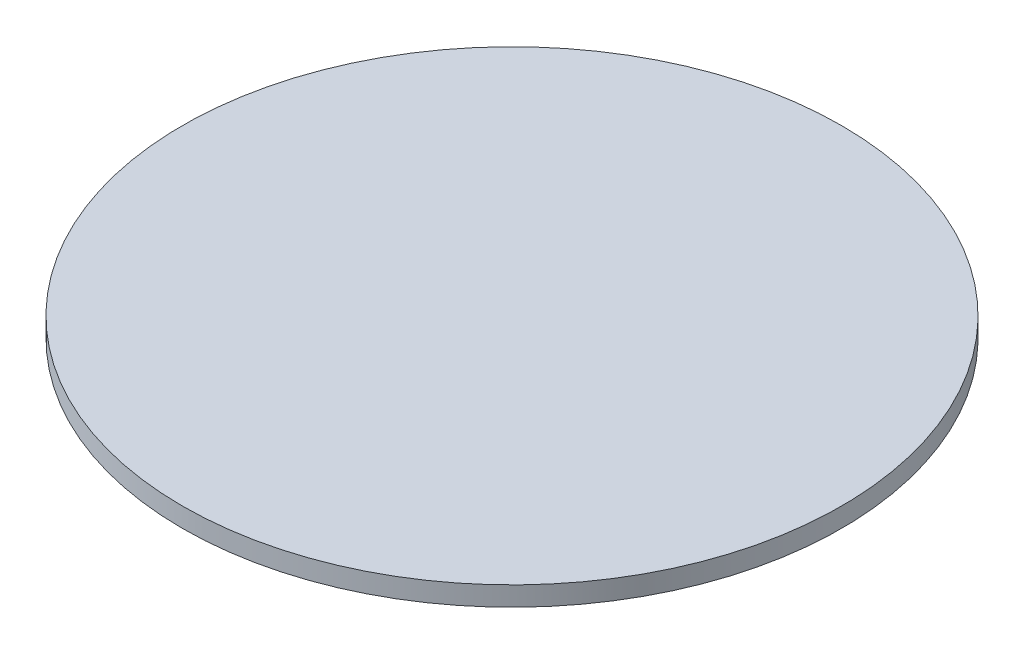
ISO-10303-21;
HEADER;
FILE_DESCRIPTION(('STEP AP214'),'2;1');
FILE_NAME('part.step','',(''),(''),'','','');
FILE_SCHEMA(('AUTOMOTIVE_DESIGN { 1 0 10303 214 1 1 1 1 }'));
ENDSEC;
DATA;
#1=APPLICATION_CONTEXT('core data for automotive mechanical design processes');
#2=APPLICATION_PROTOCOL_DEFINITION('international standard','automotive_design',2000,#1);
#3=PRODUCT_CONTEXT('',#1,'mechanical');
#4=PRODUCT('Part','Part','',(#3));
#5=PRODUCT_RELATED_PRODUCT_CATEGORY('part','',(#4));
#6=PRODUCT_DEFINITION_FORMATION('','',#4);
#7=PRODUCT_DEFINITION_CONTEXT('part definition',#1,'design');
#8=PRODUCT_DEFINITION('design','',#6,#7);
#9=PRODUCT_DEFINITION_SHAPE('','',#8);
#10=(LENGTH_UNIT() NAMED_UNIT(*) SI_UNIT(.MILLI.,.METRE.));
#11=(NAMED_UNIT(*) PLANE_ANGLE_UNIT() SI_UNIT($,.RADIAN.));
#12=(NAMED_UNIT(*) SI_UNIT($,.STERADIAN.) SOLID_ANGLE_UNIT());
#13=UNCERTAINTY_MEASURE_WITH_UNIT(LENGTH_MEASURE(1.E-05),#10,'distance_accuracy_value','');
#14=(GEOMETRIC_REPRESENTATION_CONTEXT(3) GLOBAL_UNCERTAINTY_ASSIGNED_CONTEXT((#13)) GLOBAL_UNIT_ASSIGNED_CONTEXT((#10,
#11,#12)) REPRESENTATION_CONTEXT('',''));
#15=CARTESIAN_POINT('',(0.,0.,0.));
#16=DIRECTION('',(0.,0.,1.));
#17=DIRECTION('',(1.,0.,0.));
#18=AXIS2_PLACEMENT_3D('',#15,#16,#17);
#19=CARTESIAN_POINT('',(0.,5.,0.));
#20=DIRECTION('',(0.,-1.,0.));
#21=DIRECTION('',(0.,0.,-1.));
#22=AXIS2_PLACEMENT_3D('',#19,#20,#21);
#23=CYLINDRICAL_SURFACE('',#22,85.);
#24=CARTESIAN_POINT('',(0.,5.,0.));
#25=DIRECTION('',(0.,1.,0.));
#26=DIRECTION('',(0.,0.,1.));
#27=AXIS2_PLACEMENT_3D('',#24,#25,#26);
#28=CIRCLE('',#27,85.);
#29=CARTESIAN_POINT('',(0.,5.,85.));
#30=VERTEX_POINT('',#29);
#31=EDGE_CURVE('E10',#30,#30,#28,.T.);
#32=ORIENTED_EDGE('',*,*,#31,.F.);
#33=EDGE_LOOP('',(#32));
#34=FACE_BOUND('',#33,.T.);
#35=CARTESIAN_POINT('',(0.,0.,0.));
#36=DIRECTION('',(0.,1.,0.));
#37=DIRECTION('',(0.,0.,1.));
#38=AXIS2_PLACEMENT_3D('',#35,#36,#37);
#39=CIRCLE('',#38,85.);
#40=CARTESIAN_POINT('',(0.,0.,85.));
#41=VERTEX_POINT('',#40);
#42=EDGE_CURVE('E34',#41,#41,#39,.T.);
#43=ORIENTED_EDGE('',*,*,#42,.T.);
#44=EDGE_LOOP('',(#43));
#45=FACE_BOUND('',#44,.T.);
#46=ADVANCED_FACE('F31',(#34,#45),#23,.T.);
#47=CARTESIAN_POINT('',(0.,5.,0.));
#48=DIRECTION('',(0.,1.,0.));
#49=DIRECTION('',(0.,0.,1.));
#50=AXIS2_PLACEMENT_3D('',#47,#48,#49);
#51=PLANE('',#50);
#52=ORIENTED_EDGE('',*,*,#31,.T.);
#53=EDGE_LOOP('',(#52));
#54=FACE_BOUND('',#53,.T.);
#55=ADVANCED_FACE('F46',(#54),#51,.T.);
#56=CARTESIAN_POINT('',(0.,0.,0.));
#57=DIRECTION('',(0.,1.,0.));
#58=DIRECTION('',(0.,0.,1.));
#59=AXIS2_PLACEMENT_3D('',#56,#57,#58);
#60=PLANE('',#59);
#61=ORIENTED_EDGE('',*,*,#42,.F.);
#62=EDGE_LOOP('',(#61));
#63=FACE_BOUND('',#62,.T.);
#64=ADVANCED_FACE('F44',(#63),#60,.F.);
#65=CLOSED_SHELL('',(#46,#55,#64));
#66=MANIFOLD_SOLID_BREP('B2',#65);
#67=ADVANCED_BREP_SHAPE_REPRESENTATION('',(#18,#66),#14);
#68=SHAPE_DEFINITION_REPRESENTATION(#9,#67);
ENDSEC;
END-ISO-10303-21;
